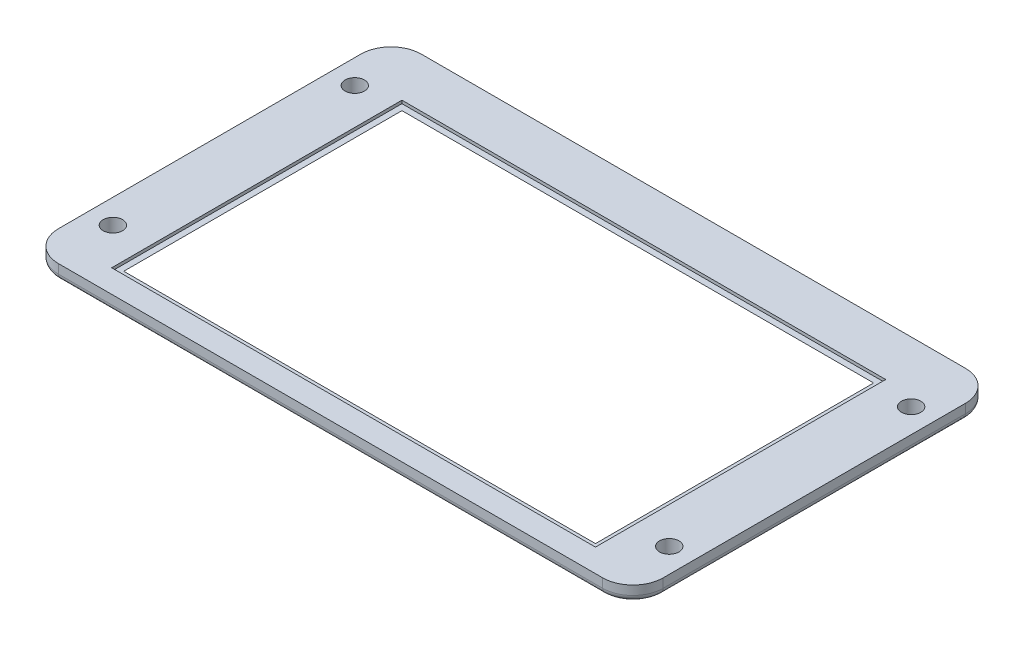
from build123d import *

# Parameters (mm, degrees)
SKETCH1_W           = 127
SKETCH1_H           = 76.2
BOSS_EXTRUDE1_DEPTH = 3.175
SKETCH5_R           = 2.032
CUT_EXTRUDE4_DEPTH  = 149.140205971
FILLET1_R           = 6.35
SKETCH2_W           = 99.06
SKETCH2_H           = 58.42
CUT_EXTRUDE5_DEPTH  = 149.140205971
CHAMFER1_SIZE       = 2.54
SKETCH6_W           = 101.6
SKETCH6_H           = 60.96
CUT_EXTRUDE6_DEPTH  = 0.635
FILLET2_R           = 1.27


with BuildPart() as part:
    # Sketch1 → Boss-Extrude1 (new body)
    with BuildSketch(Plane(origin=(0, 0, 0), x_dir=(1, 0, 0), z_dir=(0, 1, 0))):
        with Locations((63.5, 38.1)):
            Rectangle(SKETCH1_W, SKETCH1_H)
    extrude(amount=BOSS_EXTRUDE1_DEPTH)

    # Sketch5 → Cut-Extrude4 (cut, through all)
    with BuildSketch(Plane(origin=(0, 3.175, 0), x_dir=(1, 0, 0), z_dir=(0, 1, 0))):
        with Locations(Location((5.08, 63.5, 0), (0, 0, 270))):
            Circle(SKETCH5_R)
        with Locations(Location((5.08, 12.7, 0), (0, 0, 270))):
            Circle(SKETCH5_R)
        with Locations(Location((121.92, 63.5, 0), (0, 0, 270))):
            Circle(SKETCH5_R)
        with Locations(Location((121.92, 12.7, 0), (0, 0, 270))):
            Circle(SKETCH5_R)
    extrude(amount=-CUT_EXTRUDE4_DEPTH, mode=Mode.SUBTRACT)

    # Fillet1
    fillet1_edges = [part.edges().sort_by_distance(p)[0] for p in [
        (0, 1.5875, -76.2),
        (127, 1.5875, -76.2),
        (127, 1.5875, 0),
        (0, 1.5875, 0),
    ]]
    fillet(fillet1_edges, radius=FILLET1_R)

    # Sketch2 → Cut-Extrude5 (cut, through all)
    with BuildSketch(Plane(origin=(0, 3.175, 0), x_dir=(1, 0, 0), z_dir=(0, 1, 0))):
        with Locations((63.5, 35.306)):
            Rectangle(SKETCH2_W, SKETCH2_H)
    extrude(amount=-CUT_EXTRUDE5_DEPTH, mode=Mode.SUBTRACT)

    # Chamfer1
    chamfer1_edges = [part.edges().sort_by_distance(p)[0] for p in [
        (13.97, 0, -35.306),
        (63.5, 0, -64.516),
        (113.03, 0, -35.306),
        (63.5, 0, -6.096),
    ]]
    chamfer(chamfer1_edges, length=CHAMFER1_SIZE)

    # Sketch6 → Cut-Extrude6 (cut)
    with BuildSketch(Plane(origin=(0, 3.175, 0), x_dir=(1, 0, 0), z_dir=(0, 1, 0))):
        with Locations((63.5, 35.306)):
            Rectangle(SKETCH6_W, SKETCH6_H)
    extrude(amount=-CUT_EXTRUDE6_DEPTH, mode=Mode.SUBTRACT)

    # Fillet2
    fillet2_edges = [part.edges().sort_by_distance(p)[0] for p in [
        (127, 0, -38.1),
        (0, 0, -38.1),
        (63.5, 0, -76.2),
        (63.5, 0, 0),
        (1.859871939, 0, -74.340128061),
        (125.140128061, 0, -74.340128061),
        (1.859871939, 0, -1.859871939),
        (125.140128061, 0, -1.859871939),
    ]]
    fillet(fillet2_edges, radius=FILLET2_R)


solid = part.part
